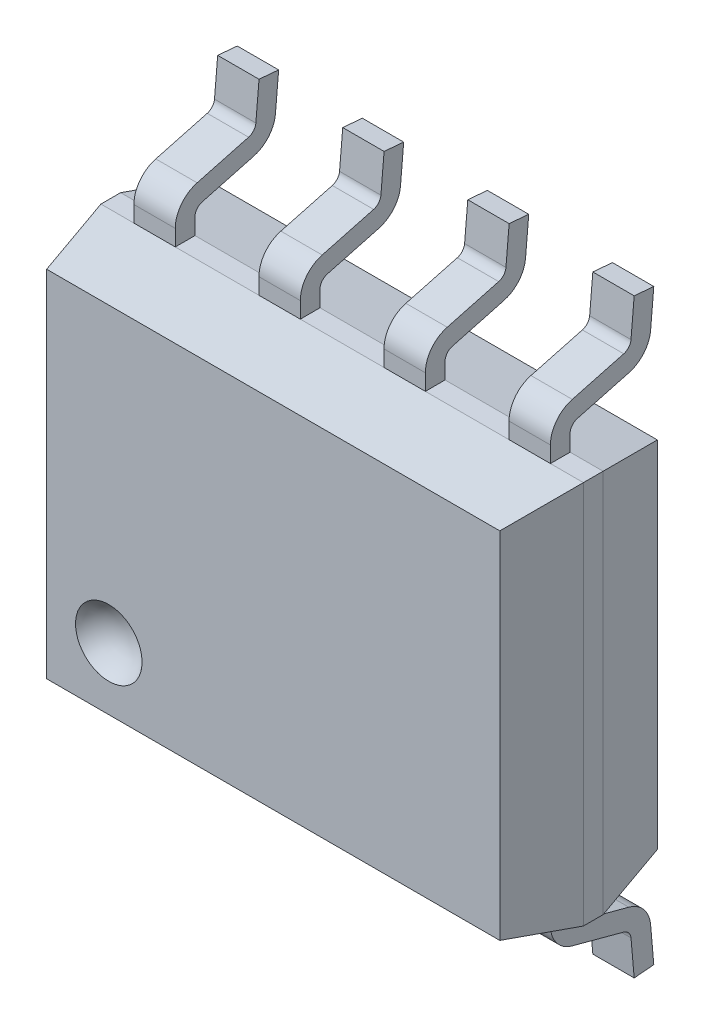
from build123d import *
from OCP.BRepFilletAPI import BRepFilletAPI_MakeChamfer
from build123d.topology import SkipClean

# Parameters (mm, degrees)
BODYWXH_W          = 1.6
BODYWXH_H          = 3.9
BOSS_BODY_DEPTH    = 2.45
CHAMFER1_SIZE      = 0.7
CHAMFER1_SIZE2     = 0.148789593
PINS_DEPTH         = 0.42
PATTERNLEADS_COUNT = 4
PATTERNLEADS_PITCH = 1.27


with BuildPart() as part:
    # BodyWxH → Boss-Body (new, symmetric)
    with BuildSketch(Plane(origin=(0, 0, 0), x_dir=(0, 0, -1), z_dir=(1, 0, 0))):
        with Locations((-0.95, 0)):
            Rectangle(BODYWXH_W, BODYWXH_H)
    extrude(amount=BOSS_BODY_DEPTH, both=True)

    # Chamfer1: one chamfer whose edges measure the first distance from different faces: ONE call of the kernel's chamfer builder (chamfer() names one face for all edges)
    chamfer1_edges_1 = [part.edges().sort_by_distance(p)[0] for p in [
        (2.45, 0, 0.15),
        (2.45, 0, 1.75),
    ]]
    chamfer1_side_1 = [part.faces().sort_by_distance(p)[0] for p in [
        (2.45, 0, 0.95),
    ]]
    chamfer1_edges_2 = [part.edges().sort_by_distance(p)[0] for p in [
        (-2.45, 0, 0.15),
        (-2.45, 0, 1.75),
    ]]
    chamfer1_side_2 = [part.faces().sort_by_distance(p)[0] for p in [
        (-2.45, 0, 0.95),
    ]]
    chamfer1_edges_3 = [part.edges().sort_by_distance(p)[0] for p in [
        (0, 1.95, 1.75),
        (0, 1.95, 0.15),
    ]]
    chamfer1_side_3 = [part.faces().sort_by_distance(p)[0] for p in [
        (0, 1.95, 0.95),
    ]]
    chamfer1_edges_4 = [part.edges().sort_by_distance(p)[0] for p in [
        (0, -1.95, 0.15),
        (0, -1.95, 1.75),
    ]]
    chamfer1_side_4 = [part.faces().sort_by_distance(p)[0] for p in [
        (0, -1.95, 0.95),
    ]]
    chamfer1 = BRepFilletAPI_MakeChamfer(part.part.solid().wrapped)
    for e in chamfer1_edges_1:
        chamfer1.Add(CHAMFER1_SIZE, CHAMFER1_SIZE2, e.wrapped, chamfer1_side_1[0].wrapped)  # the first distance lies on this face
    for e in chamfer1_edges_2:
        chamfer1.Add(CHAMFER1_SIZE, CHAMFER1_SIZE2, e.wrapped, chamfer1_side_2[0].wrapped)  # the first distance lies on this face
    for e in chamfer1_edges_3:
        chamfer1.Add(CHAMFER1_SIZE, CHAMFER1_SIZE2, e.wrapped, chamfer1_side_3[0].wrapped)  # the first distance lies on this face
    for e in chamfer1_edges_4:
        chamfer1.Add(CHAMFER1_SIZE, CHAMFER1_SIZE2, e.wrapped, chamfer1_side_4[0].wrapped)  # the first distance lies on this face
    add(Compound.cast(chamfer1.Shape()), mode=Mode.REPLACE)

    # LeadCross → Pins (add)
    with BuildSketch(Plane(origin=(-2.115, 0, 0), x_dir=(0, 0, -1), z_dir=(1, 0, 0))):
        with BuildLine():
            Line((0, -2.982568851), (-0.19923894, -3))
            Line((-0.19923894, -3), (-0.231516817, -2.631062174))
            ThreePointArc((-0.231516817, -2.631062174), (-0.254531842, -2.575498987), (-0.305254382, -2.543185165))
            Line((-0.305254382, -2.543185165), (-0.827645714, -2.40321083))
            ThreePointArc((-0.827645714, -2.40321083), (-0.988006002, -2.296061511), (-1.05, -2.113433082))
            Line((-1.05, -2.113433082), (-1.05, 2.113433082))
            ThreePointArc((-1.05, 2.113433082), (-0.988006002, 2.296061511), (-0.827645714, 2.40321083))
            Line((-0.827645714, 2.40321083), (-0.305254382, 2.543185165))
            ThreePointArc((-0.305254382, 2.543185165), (-0.254531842, 2.575498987), (-0.231516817, 2.631062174))
            Line((-0.231516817, 2.631062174), (-0.19923894, 3))
            Line((-0.19923894, 3), (0, 2.982568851))
            Line((0, 2.982568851), (-0.032277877, 2.613631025))
            ThreePointArc((-0.032277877, 2.613631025), (-0.101322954, 2.446941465), (-0.253490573, 2.35))
            Line((-0.253490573, 2.35), (-0.775881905, 2.210025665))
            ThreePointArc((-0.775881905, 2.210025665), (-0.829335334, 2.174309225), (-0.85, 2.113433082))
            Line((-0.85, 2.113433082), (-0.85, -2.113433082))
            ThreePointArc((-0.85, -2.113433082), (-0.829335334, -2.174309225), (-0.775881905, -2.210025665))
            Line((-0.775881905, -2.210025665), (-0.253490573, -2.35))
            ThreePointArc((-0.253490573, -2.35), (-0.101322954, -2.446941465), (-0.032277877, -2.613631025))
            Line((-0.032277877, -2.613631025), (0, -2.982568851))
        make_face()
    pins = extrude(amount=PINS_DEPTH)

    # PatternLeads: Pins ×4
    with Locations(*[(i * PATTERNLEADS_PITCH, 0, 0) for i in range(1, PATTERNLEADS_COUNT)]):
        add(pins)

    # Pin1Indent → Cut-Pin1Indent (revolve, cut)
    with SkipClean():  # the faces are left unmerged after this step: merging them gives an invalid solid
        with BuildSketch(Plane(origin=(-1.67, 0, 0), x_dir=(0, 0, -1), z_dir=(1, 0, 0))):
            with BuildLine():
                Line((-1.945, -0.78), (-1.945, -1.56))
                ThreePointArc((-1.945, -1.56), (-1.555, -1.17), (-1.945, -0.78))
            make_face()
        revolve(axis=Axis((-1.67, -0.78, 1.945), (0, -1, 0)), mode=Mode.SUBTRACT)


solid = part.part
